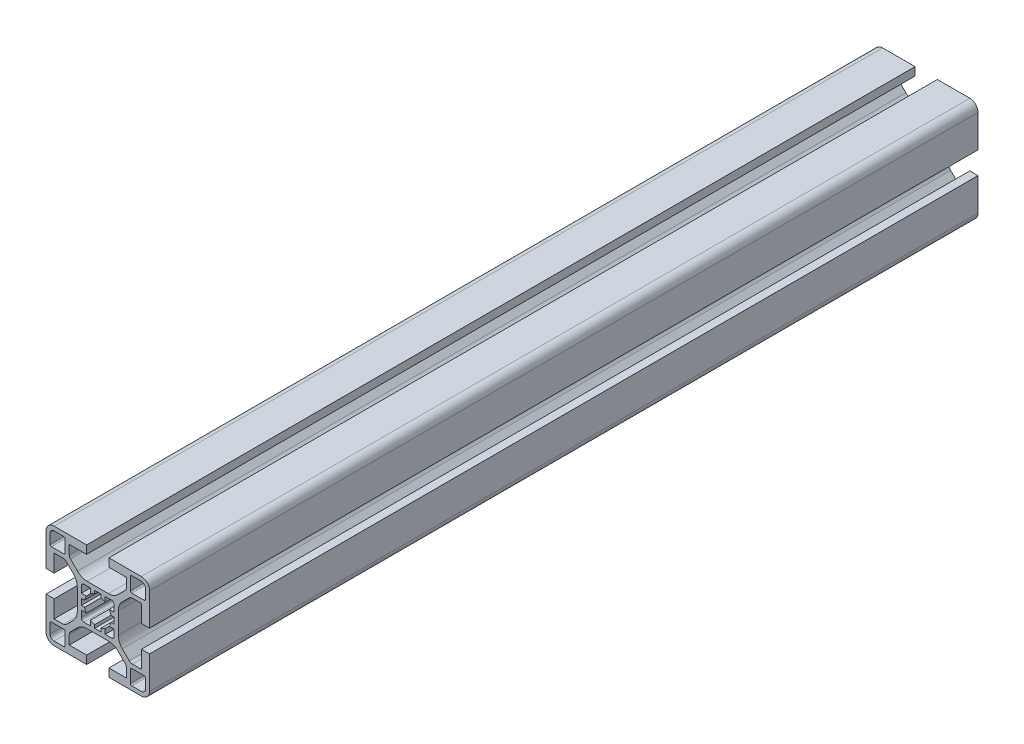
from build123d import *

# Parameters (mm, degrees)
SKETCH1_R           = 5
BOSS_EXTRUDE1_DEPTH = 304.8
CUT_EXTRUDE1_DEPTH  = 6000
CUT_EXTRUDE2_DEPTH  = 6000
CUT_EXTRUDE3_DEPTH  = 6000
CUT_EXTRUDE4_DEPTH  = 6000
CUT_EXTRUDE5_DEPTH  = 6000


with BuildPart() as part:
    # Sketch1 → Boss-Extrude1 (new body)
    with BuildSketch(Plane.XY):
        with BuildLine():
            Line((-19.05, -4.1), (-19.05, -16.05))
            ThreePointArc((-19.05, -16.05), (-18.171320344, -18.171320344), (-16.05, -19.05))
            Line((-16.05, -19.05), (-4.1, -19.05))
            Line((-4.1, -19.05), (-4.1, -16.05))
            Line((-4.1, -16.05), (-10.5, -16.05))
            Line((-10.5, -16.05), (-10.5, -12.7127))
            ThreePointArc((-10.5, -12.7127), (-10.378208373, -12.100409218), (-10.03135, -11.58135))
            Line((-10.03135, -11.58135), (-7.464465, -9.014465))
            ThreePointArc((-7.464465, -9.014465), (-5.842347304, -7.930602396), (-3.92893, -7.55))
            Line((-3.92893, -7.55), (3.92893, -7.55))
            ThreePointArc((3.92893, -7.55), (5.842347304, -7.930602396), (7.464465, -9.014465))
            Line((7.464465, -9.014465), (10.03135, -11.58135))
            ThreePointArc((10.03135, -11.58135), (10.378208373, -12.100409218), (10.5, -12.7127))
            Line((10.5, -12.7127), (10.5, -16.05))
            Line((10.5, -16.05), (4.1, -16.05))
            Line((4.1, -16.05), (4.1, -19.05))
            Line((4.1, -19.05), (16.05, -19.05))
            ThreePointArc((16.05, -19.05), (18.171320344, -18.171320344), (19.05, -16.05))
            Line((19.05, -16.05), (19.05, -4.1))
            Line((19.05, -4.1), (16.05, -4.1))
            Line((16.05, -4.1), (16.05, -10.5))
            Line((16.05, -10.5), (12.7127, -10.5))
            ThreePointArc((12.7127, -10.5), (12.100409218, -10.378208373), (11.58135, -10.03135))
            Line((11.58135, -10.03135), (9.014465, -7.464465))
            ThreePointArc((9.014465, -7.464465), (7.930602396, -5.842347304), (7.55, -3.92893))
            Line((7.55, -3.92893), (7.55, 3.92893))
            ThreePointArc((7.55, 3.92893), (7.930602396, 5.842347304), (9.014465, 7.464465))
            Line((9.014465, 7.464465), (11.58135, 10.03135))
            ThreePointArc((11.58135, 10.03135), (12.100409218, 10.378208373), (12.7127, 10.5))
            Line((12.7127, 10.5), (16.05, 10.5))
            Line((16.05, 10.5), (16.05, 4.1))
            Line((16.05, 4.1), (19.05, 4.1))
            Line((19.05, 4.1), (19.05, 16.05))
            ThreePointArc((19.05, 16.05), (18.171320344, 18.171320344), (16.05, 19.05))
            Line((16.05, 19.05), (4.1, 19.05))
            Line((4.1, 19.05), (4.1, 16.05))
            Line((4.1, 16.05), (10.5, 16.05))
            Line((10.5, 16.05), (10.5, 12.7127))
            ThreePointArc((10.5, 12.7127), (10.378208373, 12.100409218), (10.03135, 11.58135))
            Line((10.03135, 11.58135), (7.464465, 9.014465))
            ThreePointArc((7.464465, 9.014465), (5.842347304, 7.930602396), (3.92893, 7.55))
            Line((3.92893, 7.55), (-3.92893, 7.55))
            ThreePointArc((-3.92893, 7.55), (-5.842347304, 7.930602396), (-7.464465, 9.014465))
            Line((-7.464465, 9.014465), (-10.03135, 11.58135))
            ThreePointArc((-10.03135, 11.58135), (-10.378208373, 12.100409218), (-10.5, 12.7127))
            Line((-10.5, 12.7127), (-10.5, 16.05))
            Line((-10.5, 16.05), (-4.1, 16.05))
            Line((-4.1, 16.05), (-4.1, 19.05))
            Line((-4.1, 19.05), (-16.05, 19.05))
            ThreePointArc((-16.05, 19.05), (-18.171320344, 18.171320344), (-19.05, 16.05))
            Line((-19.05, 16.05), (-19.05, 4.1))
            Line((-19.05, 4.1), (-16.05, 4.1))
            Line((-16.05, 4.1), (-16.05, 10.5))
            Line((-16.05, 10.5), (-12.7127, 10.5))
            ThreePointArc((-12.7127, 10.5), (-12.100409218, 10.378208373), (-11.58135, 10.03135))
            Line((-11.58135, 10.03135), (-9.014465, 7.464465))
            ThreePointArc((-9.014465, 7.464465), (-7.930602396, 5.842347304), (-7.55, 3.92893))
            Line((-7.55, 3.92893), (-7.55, -3.92893))
            ThreePointArc((-7.55, -3.92893), (-7.930602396, -5.842347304), (-9.014465, -7.464465))
            Line((-9.014465, -7.464465), (-11.58135, -10.03135))
            ThreePointArc((-11.58135, -10.03135), (-12.100409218, -10.378208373), (-12.7127, -10.5))
            Line((-12.7127, -10.5), (-16.05, -10.5))
            Line((-16.05, -10.5), (-16.05, -4.1))
            Line((-16.05, -4.1), (-19.05, -4.1))
        make_face()
        Circle(SKETCH1_R, mode=Mode.SUBTRACT)
    extrude(amount=-BOSS_EXTRUDE1_DEPTH)

    # Sketch2 → Cut-Extrude1 (cut)
    with BuildSketch(Plane.XY):
        with BuildLine():
            Line((-17.55, -12.5), (-17.55, -16.05))
            ThreePointArc((-17.55, -16.05), (-17.110660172, -17.110660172), (-16.05, -17.55))
            Line((-16.05, -17.55), (-12.5, -17.55))
            ThreePointArc((-12.5, -17.55), (-12.146446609, -17.403553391), (-12, -17.05))
            Line((-12, -17.05), (-12, -12.5))
            ThreePointArc((-12, -12.5), (-12.146446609, -12.146446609), (-12.5, -12))
            Line((-12.5, -12), (-17.05, -12))
            ThreePointArc((-17.05, -12), (-17.403553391, -12.146446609), (-17.55, -12.5))
        make_face()
    extrude(amount=-CUT_EXTRUDE1_DEPTH, mode=Mode.SUBTRACT)

    # Sketch3 → Cut-Extrude2 (cut)
    with BuildSketch(Plane.XY):
        with BuildLine():
            Line((12.5, -17.55), (16.05, -17.55))
            ThreePointArc((16.05, -17.55), (17.110660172, -17.110660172), (17.55, -16.05))
            Line((17.55, -16.05), (17.55, -12.5))
            ThreePointArc((17.55, -12.5), (17.403553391, -12.146446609), (17.05, -12))
            Line((17.05, -12), (12.5, -12))
            ThreePointArc((12.5, -12), (12.146446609, -12.146446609), (12, -12.5))
            Line((12, -12.5), (12, -17.05))
            ThreePointArc((12, -17.05), (12.146446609, -17.403553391), (12.5, -17.55))
        make_face()
    extrude(amount=-CUT_EXTRUDE2_DEPTH, mode=Mode.SUBTRACT)

    # Sketch4 → Cut-Extrude3 (cut)
    with BuildSketch(Plane.XY):
        with BuildLine():
            Line((-6.05, 1.06724), (-6.05, -1.19102))
            Line((-6.05, -1.19102), (-4.85654377, -1.189110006))
            ThreePointArc((-4.85654377, -1.189110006), (-4.594960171, -1.971380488), (-4.208325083, -2.7))
            Line((-4.208325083, -2.7), (-6.05, -2.7))
            Line((-6.05, -2.7), (-6.05, -5.05))
            ThreePointArc((-6.05, -5.05), (-5.757106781, -5.757106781), (-5.05, -6.05))
            Line((-5.05, -6.05), (-2.7, -6.05))
            Line((-2.7, -6.05), (-2.7, -4.208325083))
            ThreePointArc((-2.7, -4.208325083), (-1.952880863, -4.602853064), (-1.15, -4.865953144))
            Line((-1.15, -4.865953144), (-1.15, -6.05))
            Line((-1.15, -6.05), (1.15, -6.05))
            Line((1.15, -6.05), (1.15, -4.865953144))
            ThreePointArc((1.15, -4.865953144), (1.952880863, -4.602853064), (2.7, -4.208325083))
            Line((2.7, -4.208325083), (2.7, -6.05))
            Line((2.7, -6.05), (5.05, -6.05))
            ThreePointArc((5.05, -6.05), (5.757106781, -5.757106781), (6.05, -5.05))
            Line((6.05, -5.05), (6.05, -2.7))
            Line((6.05, -2.7), (4.208325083, -2.7))
            ThreePointArc((4.208325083, -2.7), (4.598107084, -1.964029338), (4.860322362, -1.173569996))
            Line((4.860322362, -1.173569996), (6.05, -1.17167))
            Line((6.05, -1.17167), (6.05, 1.10628))
            Line((6.05, 1.10628), (4.876934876, 1.102499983))
            ThreePointArc((4.876934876, 1.102499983), (4.612319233, 1.930417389), (4.208325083, 2.7))
            Line((4.208325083, 2.7), (6.05, 2.7))
            Line((6.05, 2.7), (6.05, 5.05))
            ThreePointArc((6.05, 5.05), (5.757106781, 5.757106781), (5.05, 6.05))
            Line((5.05, 6.05), (2.7, 6.05))
            Line((2.7, 6.05), (2.7, 4.208325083))
            ThreePointArc((2.7, 4.208325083), (1.952880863, 4.602853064), (1.15, 4.865953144))
            Line((1.15, 4.865953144), (1.15, 6.05))
            Line((1.15, 6.05), (-1.15, 6.05))
            Line((-1.15, 6.05), (-1.15, 4.865953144))
            ThreePointArc((-1.15, 4.865953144), (-1.952880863, 4.602853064), (-2.7, 4.208325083))
            Line((-2.7, 4.208325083), (-2.7, 6.05))
            Line((-2.7, 6.05), (-5.05, 6.05))
            ThreePointArc((-5.05, 6.05), (-5.757106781, 5.757106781), (-6.05, 5.05))
            Line((-6.05, 5.05), (-6.05, 2.7))
            Line((-6.05, 2.7), (-4.208325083, 2.7))
            ThreePointArc((-4.208325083, 2.7), (-4.618524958, 1.9155227), (-4.883949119, 1.071000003))
            Line((-4.883949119, 1.071000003), (-6.05, 1.06724))
        make_face()
    extrude(amount=-CUT_EXTRUDE3_DEPTH, mode=Mode.SUBTRACT)

    # Sketch5 → Cut-Extrude4 (cut)
    with BuildSketch(Plane.XY):
        with BuildLine():
            Line((12, 17.05), (12, 12.5))
            ThreePointArc((12, 12.5), (12.146446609, 12.146446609), (12.5, 12))
            Line((12.5, 12), (17.05, 12))
            ThreePointArc((17.05, 12), (17.403553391, 12.146446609), (17.55, 12.5))
            Line((17.55, 12.5), (17.55, 16.05))
            ThreePointArc((17.55, 16.05), (17.110660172, 17.110660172), (16.05, 17.55))
            Line((16.05, 17.55), (12.5, 17.55))
            ThreePointArc((12.5, 17.55), (12.146446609, 17.403553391), (12, 17.05))
        make_face()
    extrude(amount=-CUT_EXTRUDE4_DEPTH, mode=Mode.SUBTRACT)

    # Sketch6 → Cut-Extrude5 (cut)
    with BuildSketch(Plane.XY):
        with BuildLine():
            Line((-17.05, 12), (-12.5, 12))
            ThreePointArc((-12.5, 12), (-12.146446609, 12.146446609), (-12, 12.5))
            Line((-12, 12.5), (-12, 17.05))
            ThreePointArc((-12, 17.05), (-12.146446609, 17.403553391), (-12.5, 17.55))
            Line((-12.5, 17.55), (-16.05, 17.55))
            ThreePointArc((-16.05, 17.55), (-17.110660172, 17.110660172), (-17.55, 16.05))
            Line((-17.55, 16.05), (-17.55, 12.5))
            ThreePointArc((-17.55, 12.5), (-17.403553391, 12.146446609), (-17.05, 12))
        make_face()
    extrude(amount=-CUT_EXTRUDE5_DEPTH, mode=Mode.SUBTRACT)


solid = part.part
